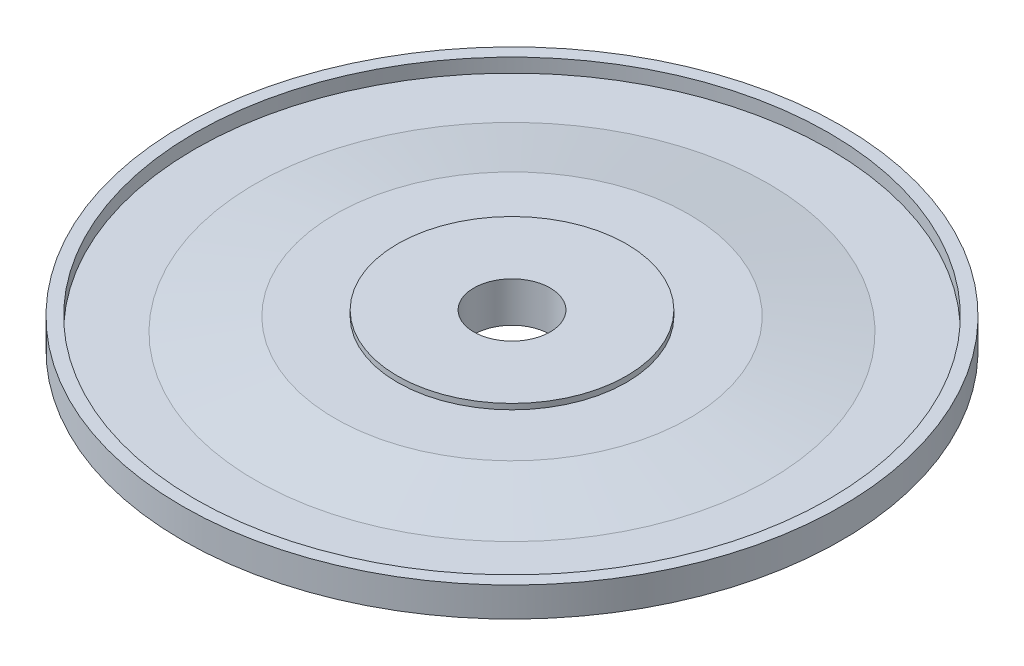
ISO-10303-21;
HEADER;
FILE_DESCRIPTION(('STEP AP214'),'2;1');
FILE_NAME('part.step','',(''),(''),'','','');
FILE_SCHEMA(('AUTOMOTIVE_DESIGN { 1 0 10303 214 1 1 1 1 }'));
ENDSEC;
DATA;
#1=APPLICATION_CONTEXT('core data for automotive mechanical design processes');
#2=APPLICATION_PROTOCOL_DEFINITION('international standard','automotive_design',2000,#1);
#3=PRODUCT_CONTEXT('',#1,'mechanical');
#4=PRODUCT('Part','Part','',(#3));
#5=PRODUCT_RELATED_PRODUCT_CATEGORY('part','',(#4));
#6=PRODUCT_DEFINITION_FORMATION('','',#4);
#7=PRODUCT_DEFINITION_CONTEXT('part definition',#1,'design');
#8=PRODUCT_DEFINITION('design','',#6,#7);
#9=PRODUCT_DEFINITION_SHAPE('','',#8);
#10=(LENGTH_UNIT() NAMED_UNIT(*) SI_UNIT(.MILLI.,.METRE.));
#11=(NAMED_UNIT(*) PLANE_ANGLE_UNIT() SI_UNIT($,.RADIAN.));
#12=(NAMED_UNIT(*) SI_UNIT($,.STERADIAN.) SOLID_ANGLE_UNIT());
#13=UNCERTAINTY_MEASURE_WITH_UNIT(LENGTH_MEASURE(1.E-05),#10,'distance_accuracy_value','');
#14=(GEOMETRIC_REPRESENTATION_CONTEXT(3) GLOBAL_UNCERTAINTY_ASSIGNED_CONTEXT((#13)) GLOBAL_UNIT_ASSIGNED_CONTEXT((#10,
#11,#12)) REPRESENTATION_CONTEXT('',''));
#15=CARTESIAN_POINT('',(0.,0.,0.));
#16=DIRECTION('',(0.,0.,1.));
#17=DIRECTION('',(1.,0.,0.));
#18=AXIS2_PLACEMENT_3D('',#15,#16,#17);
#19=CARTESIAN_POINT('',(0.,0.,0.));
#20=DIRECTION('',(0.,-1.,0.));
#21=DIRECTION('',(0.,0.,-1.));
#22=AXIS2_PLACEMENT_3D('',#19,#20,#21);
#23=CYLINDRICAL_SURFACE('',#22,16.5);
#24=CARTESIAN_POINT('',(0.,0.,0.));
#25=DIRECTION('',(0.,-1.,0.));
#26=DIRECTION('',(0.,0.,-1.));
#27=AXIS2_PLACEMENT_3D('',#24,#25,#26);
#28=CIRCLE('',#27,16.5);
#29=CARTESIAN_POINT('',(0.,0.,-16.5));
#30=VERTEX_POINT('',#29);
#31=EDGE_CURVE('E72',#30,#30,#28,.T.);
#32=ORIENTED_EDGE('',*,*,#31,.T.);
#33=EDGE_LOOP('',(#32));
#34=FACE_BOUND('',#33,.T.);
#35=CARTESIAN_POINT('',(0.,-0.8,0.));
#36=DIRECTION('',(0.,-1.,0.));
#37=DIRECTION('',(0.,0.,-1.));
#38=AXIS2_PLACEMENT_3D('',#35,#36,#37);
#39=CIRCLE('',#38,16.5);
#40=CARTESIAN_POINT('',(0.,-0.8,-16.5));
#41=VERTEX_POINT('',#40);
#42=EDGE_CURVE('E10',#41,#41,#39,.T.);
#43=ORIENTED_EDGE('',*,*,#42,.F.);
#44=EDGE_LOOP('',(#43));
#45=FACE_BOUND('',#44,.T.);
#46=ADVANCED_FACE('F32',(#34,#45),#23,.T.);
#47=CARTESIAN_POINT('',(5.5,-0.8,0.));
#48=DIRECTION('',(0.,-1.,0.));
#49=DIRECTION('',(0.,0.,-1.));
#50=AXIS2_PLACEMENT_3D('',#47,#48,#49);
#51=PLANE('',#50);
#52=ORIENTED_EDGE('',*,*,#42,.T.);
#53=EDGE_LOOP('',(#52));
#54=FACE_BOUND('',#53,.T.);
#55=CARTESIAN_POINT('',(0.,-0.8,0.));
#56=DIRECTION('',(0.,-1.,0.));
#57=DIRECTION('',(0.,0.,-1.));
#58=AXIS2_PLACEMENT_3D('',#55,#56,#57);
#59=CIRCLE('',#58,5.5);
#60=CARTESIAN_POINT('',(0.,-0.8,-5.5));
#61=VERTEX_POINT('',#60);
#62=EDGE_CURVE('E38',#61,#61,#59,.T.);
#63=ORIENTED_EDGE('',*,*,#62,.F.);
#64=EDGE_LOOP('',(#63));
#65=FACE_BOUND('',#64,.T.);
#66=ADVANCED_FACE('F90',(#54,#65),#51,.T.);
#67=CARTESIAN_POINT('',(0.,0.,0.));
#68=DIRECTION('',(0.,-1.,0.));
#69=DIRECTION('',(0.,0.,-1.));
#70=AXIS2_PLACEMENT_3D('',#67,#68,#69);
#71=CYLINDRICAL_SURFACE('',#70,5.5);
#72=ORIENTED_EDGE('',*,*,#62,.T.);
#73=EDGE_LOOP('',(#72));
#74=FACE_BOUND('',#73,.T.);
#75=CARTESIAN_POINT('',(0.,5.,0.));
#76=DIRECTION('',(0.,-1.,0.));
#77=DIRECTION('',(0.,0.,-1.));
#78=AXIS2_PLACEMENT_3D('',#75,#76,#77);
#79=CIRCLE('',#78,5.5);
#80=CARTESIAN_POINT('',(0.,5.,-5.5));
#81=VERTEX_POINT('',#80);
#82=EDGE_CURVE('E42',#81,#81,#79,.T.);
#83=ORIENTED_EDGE('',*,*,#82,.F.);
#84=EDGE_LOOP('',(#83));
#85=FACE_BOUND('',#84,.T.);
#86=ADVANCED_FACE('F94',(#74,#85),#71,.F.);
#87=CARTESIAN_POINT('',(16.5,5.,0.));
#88=DIRECTION('',(0.,1.,0.));
#89=DIRECTION('',(0.,0.,1.));
#90=AXIS2_PLACEMENT_3D('',#87,#88,#89);
#91=PLANE('',#90);
#92=ORIENTED_EDGE('',*,*,#82,.T.);
#93=EDGE_LOOP('',(#92));
#94=FACE_BOUND('',#93,.T.);
#95=CARTESIAN_POINT('',(0.,5.,0.));
#96=DIRECTION('',(0.,-1.,0.));
#97=DIRECTION('',(0.,0.,-1.));
#98=AXIS2_PLACEMENT_3D('',#95,#96,#97);
#99=CIRCLE('',#98,16.5);
#100=CARTESIAN_POINT('',(0.,5.,-16.5));
#101=VERTEX_POINT('',#100);
#102=EDGE_CURVE('E46',#101,#101,#99,.T.);
#103=ORIENTED_EDGE('',*,*,#102,.F.);
#104=EDGE_LOOP('',(#103));
#105=FACE_BOUND('',#104,.T.);
#106=ADVANCED_FACE('F98',(#94,#105),#91,.T.);
#107=CARTESIAN_POINT('',(0.,0.,0.));
#108=DIRECTION('',(0.,-1.,0.));
#109=DIRECTION('',(0.,0.,-1.));
#110=AXIS2_PLACEMENT_3D('',#107,#108,#109);
#111=CYLINDRICAL_SURFACE('',#110,16.5);
#112=ORIENTED_EDGE('',*,*,#102,.T.);
#113=EDGE_LOOP('',(#112));
#114=FACE_BOUND('',#113,.T.);
#115=CARTESIAN_POINT('',(0.,4.2,0.));
#116=DIRECTION('',(0.,-1.,0.));
#117=DIRECTION('',(0.,0.,-1.));
#118=AXIS2_PLACEMENT_3D('',#115,#116,#117);
#119=CIRCLE('',#118,16.5);
#120=CARTESIAN_POINT('',(0.,4.2,-16.5));
#121=VERTEX_POINT('',#120);
#122=EDGE_CURVE('E51',#121,#121,#119,.T.);
#123=ORIENTED_EDGE('',*,*,#122,.F.);
#124=EDGE_LOOP('',(#123));
#125=FACE_BOUND('',#124,.T.);
#126=ADVANCED_FACE('F104',(#114,#125),#111,.T.);
#127=CARTESIAN_POINT('',(25.5,4.2,0.));
#128=DIRECTION('',(0.,1.,0.));
#129=DIRECTION('',(0.,0.,1.));
#130=AXIS2_PLACEMENT_3D('',#127,#128,#129);
#131=PLANE('',#130);
#132=ORIENTED_EDGE('',*,*,#122,.T.);
#133=EDGE_LOOP('',(#132));
#134=FACE_BOUND('',#133,.T.);
#135=CARTESIAN_POINT('',(0.,4.2,0.));
#136=DIRECTION('',(0.,-1.,0.));
#137=DIRECTION('',(0.,0.,-1.));
#138=AXIS2_PLACEMENT_3D('',#135,#136,#137);
#139=CIRCLE('',#138,25.5);
#140=CARTESIAN_POINT('',(0.,4.2,-25.5));
#141=VERTEX_POINT('',#140);
#142=EDGE_CURVE('E54',#141,#141,#139,.T.);
#143=ORIENTED_EDGE('',*,*,#142,.F.);
#144=EDGE_LOOP('',(#143));
#145=FACE_BOUND('',#144,.T.);
#146=ADVANCED_FACE('F108',(#134,#145),#131,.T.);
#147=CARTESIAN_POINT('',(0.,2.25,0.));
#148=DIRECTION('',(0.,-1.,0.));
#149=DIRECTION('',(0.,0.,-1.));
#150=AXIS2_PLACEMENT_3D('',#147,#148,#149);
#151=CONICAL_SURFACE('',#150,37.,1.40282877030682);
#152=ORIENTED_EDGE('',*,*,#142,.T.);
#153=EDGE_LOOP('',(#152));
#154=FACE_BOUND('',#153,.T.);
#155=CARTESIAN_POINT('',(0.,2.25,0.));
#156=DIRECTION('',(0.,-1.,0.));
#157=DIRECTION('',(0.,0.,-1.));
#158=AXIS2_PLACEMENT_3D('',#155,#156,#157);
#159=CIRCLE('',#158,37.);
#160=CARTESIAN_POINT('',(0.,2.25,-37.));
#161=VERTEX_POINT('',#160);
#162=EDGE_CURVE('E57',#161,#161,#159,.T.);
#163=ORIENTED_EDGE('',*,*,#162,.F.);
#164=EDGE_LOOP('',(#163));
#165=FACE_BOUND('',#164,.T.);
#166=ADVANCED_FACE('F112',(#154,#165),#151,.T.);
#167=CARTESIAN_POINT('',(45.7,2.25,0.));
#168=DIRECTION('',(0.,1.,0.));
#169=DIRECTION('',(0.,0.,1.));
#170=AXIS2_PLACEMENT_3D('',#167,#168,#169);
#171=PLANE('',#170);
#172=ORIENTED_EDGE('',*,*,#162,.T.);
#173=EDGE_LOOP('',(#172));
#174=FACE_BOUND('',#173,.T.);
#175=CARTESIAN_POINT('',(0.,2.25,0.));
#176=DIRECTION('',(0.,-1.,0.));
#177=DIRECTION('',(0.,0.,-1.));
#178=AXIS2_PLACEMENT_3D('',#175,#176,#177);
#179=CIRCLE('',#178,45.7);
#180=CARTESIAN_POINT('',(0.,2.25,-45.7));
#181=VERTEX_POINT('',#180);
#182=EDGE_CURVE('E60',#181,#181,#179,.T.);
#183=ORIENTED_EDGE('',*,*,#182,.F.);
#184=EDGE_LOOP('',(#183));
#185=FACE_BOUND('',#184,.T.);
#186=ADVANCED_FACE('F116',(#174,#185),#171,.T.);
#187=CARTESIAN_POINT('',(0.,0.,0.));
#188=DIRECTION('',(0.,-1.,0.));
#189=DIRECTION('',(0.,0.,-1.));
#190=AXIS2_PLACEMENT_3D('',#187,#188,#189);
#191=CYLINDRICAL_SURFACE('',#190,45.7);
#192=ORIENTED_EDGE('',*,*,#182,.T.);
#193=EDGE_LOOP('',(#192));
#194=FACE_BOUND('',#193,.T.);
#195=CARTESIAN_POINT('',(0.,4.25,0.));
#196=DIRECTION('',(0.,-1.,0.));
#197=DIRECTION('',(0.,0.,-1.));
#198=AXIS2_PLACEMENT_3D('',#195,#196,#197);
#199=CIRCLE('',#198,45.7);
#200=CARTESIAN_POINT('',(0.,4.25,-45.7));
#201=VERTEX_POINT('',#200);
#202=EDGE_CURVE('E63',#201,#201,#199,.T.);
#203=ORIENTED_EDGE('',*,*,#202,.F.);
#204=EDGE_LOOP('',(#203));
#205=FACE_BOUND('',#204,.T.);
#206=ADVANCED_FACE('F120',(#194,#205),#191,.F.);
#207=CARTESIAN_POINT('',(47.5,4.25,0.));
#208=DIRECTION('',(0.,1.,0.));
#209=DIRECTION('',(0.,0.,1.));
#210=AXIS2_PLACEMENT_3D('',#207,#208,#209);
#211=PLANE('',#210);
#212=ORIENTED_EDGE('',*,*,#202,.T.);
#213=EDGE_LOOP('',(#212));
#214=FACE_BOUND('',#213,.T.);
#215=CARTESIAN_POINT('',(0.,4.25,0.));
#216=DIRECTION('',(0.,-1.,0.));
#217=DIRECTION('',(0.,0.,-1.));
#218=AXIS2_PLACEMENT_3D('',#215,#216,#217);
#219=CIRCLE('',#218,47.5);
#220=CARTESIAN_POINT('',(0.,4.25,-47.5));
#221=VERTEX_POINT('',#220);
#222=EDGE_CURVE('E66',#221,#221,#219,.T.);
#223=ORIENTED_EDGE('',*,*,#222,.F.);
#224=EDGE_LOOP('',(#223));
#225=FACE_BOUND('',#224,.T.);
#226=ADVANCED_FACE('F86',(#214,#225),#211,.T.);
#227=CARTESIAN_POINT('',(0.,0.,0.));
#228=DIRECTION('',(0.,-1.,0.));
#229=DIRECTION('',(0.,0.,-1.));
#230=AXIS2_PLACEMENT_3D('',#227,#228,#229);
#231=CYLINDRICAL_SURFACE('',#230,47.5);
#232=ORIENTED_EDGE('',*,*,#222,.T.);
#233=EDGE_LOOP('',(#232));
#234=FACE_BOUND('',#233,.T.);
#235=CARTESIAN_POINT('',(0.,0.,0.));
#236=DIRECTION('',(0.,-1.,0.));
#237=DIRECTION('',(0.,0.,-1.));
#238=AXIS2_PLACEMENT_3D('',#235,#236,#237);
#239=CIRCLE('',#238,47.5);
#240=CARTESIAN_POINT('',(0.,0.,-47.5));
#241=VERTEX_POINT('',#240);
#242=EDGE_CURVE('E69',#241,#241,#239,.T.);
#243=ORIENTED_EDGE('',*,*,#242,.F.);
#244=EDGE_LOOP('',(#243));
#245=FACE_BOUND('',#244,.T.);
#246=ADVANCED_FACE('F80',(#234,#245),#231,.T.);
#247=CARTESIAN_POINT('',(16.5,0.,0.));
#248=DIRECTION('',(0.,-1.,0.));
#249=DIRECTION('',(0.,0.,-1.));
#250=AXIS2_PLACEMENT_3D('',#247,#248,#249);
#251=PLANE('',#250);
#252=ORIENTED_EDGE('',*,*,#242,.T.);
#253=EDGE_LOOP('',(#252));
#254=FACE_BOUND('',#253,.T.);
#255=ORIENTED_EDGE('',*,*,#31,.F.);
#256=EDGE_LOOP('',(#255));
#257=FACE_BOUND('',#256,.T.);
#258=ADVANCED_FACE('F78',(#254,#257),#251,.T.);
#259=CLOSED_SHELL('',(#46,#66,#86,#106,#126,#146,#166,#186,#206,#226,#246,#258));
#260=MANIFOLD_SOLID_BREP('B2',#259);
#261=ADVANCED_BREP_SHAPE_REPRESENTATION('',(#18,#260),#14);
#262=SHAPE_DEFINITION_REPRESENTATION(#9,#261);
ENDSEC;
END-ISO-10303-21;
